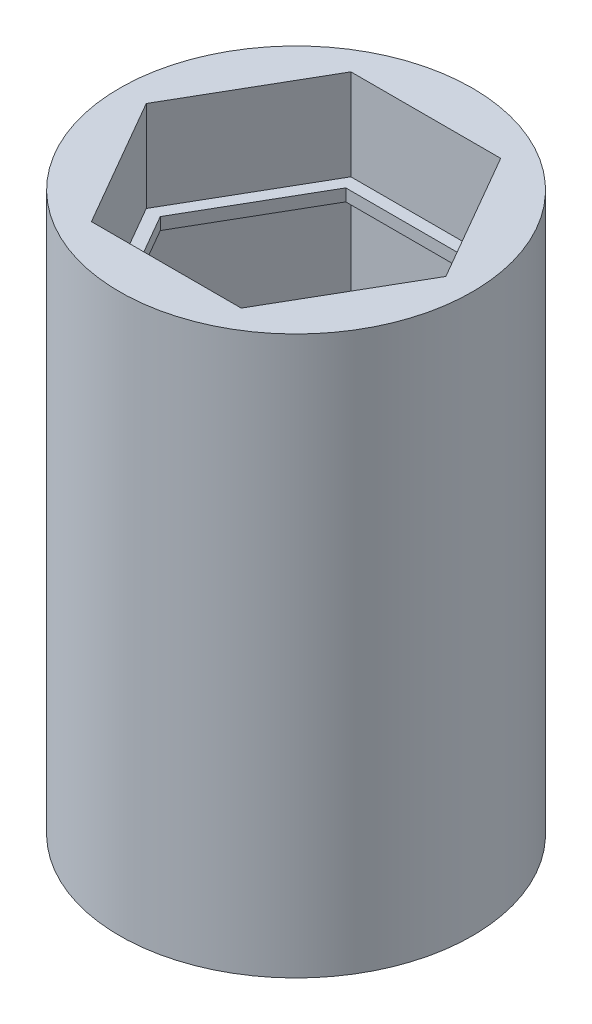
ISO-10303-21;
HEADER;
FILE_DESCRIPTION(('STEP AP214'),'2;1');
FILE_NAME('part.step','',(''),(''),'','','');
FILE_SCHEMA(('AUTOMOTIVE_DESIGN { 1 0 10303 214 1 1 1 1 }'));
ENDSEC;
DATA;
#1=APPLICATION_CONTEXT('core data for automotive mechanical design processes');
#2=APPLICATION_PROTOCOL_DEFINITION('international standard','automotive_design',2000,#1);
#3=PRODUCT_CONTEXT('',#1,'mechanical');
#4=PRODUCT('Part','Part','',(#3));
#5=PRODUCT_RELATED_PRODUCT_CATEGORY('part','',(#4));
#6=PRODUCT_DEFINITION_FORMATION('','',#4);
#7=PRODUCT_DEFINITION_CONTEXT('part definition',#1,'design');
#8=PRODUCT_DEFINITION('design','',#6,#7);
#9=PRODUCT_DEFINITION_SHAPE('','',#8);
#10=(LENGTH_UNIT() NAMED_UNIT(*) SI_UNIT(.MILLI.,.METRE.));
#11=(NAMED_UNIT(*) PLANE_ANGLE_UNIT() SI_UNIT($,.RADIAN.));
#12=(NAMED_UNIT(*) SI_UNIT($,.STERADIAN.) SOLID_ANGLE_UNIT());
#13=UNCERTAINTY_MEASURE_WITH_UNIT(LENGTH_MEASURE(1.E-05),#10,'distance_accuracy_value','');
#14=(GEOMETRIC_REPRESENTATION_CONTEXT(3) GLOBAL_UNCERTAINTY_ASSIGNED_CONTEXT((#13)) GLOBAL_UNIT_ASSIGNED_CONTEXT((#10,
#11,#12)) REPRESENTATION_CONTEXT('',''));
#15=CARTESIAN_POINT('',(0.,0.,0.));
#16=DIRECTION('',(0.,0.,1.));
#17=DIRECTION('',(1.,0.,0.));
#18=AXIS2_PLACEMENT_3D('',#15,#16,#17);
#19=CARTESIAN_POINT('',(0.,58.42,0.));
#20=DIRECTION('',(0.,-1.,0.));
#21=DIRECTION('',(0.,0.,-1.));
#22=AXIS2_PLACEMENT_3D('',#19,#20,#21);
#23=CYLINDRICAL_SURFACE('',#22,18.4785);
#24=CARTESIAN_POINT('',(0.,58.42,0.));
#25=DIRECTION('',(0.,1.,0.));
#26=DIRECTION('',(0.,0.,1.));
#27=AXIS2_PLACEMENT_3D('',#24,#25,#26);
#28=CIRCLE('',#27,18.4785);
#29=CARTESIAN_POINT('',(0.,58.42,-18.4785));
#30=VERTEX_POINT('',#29);
#31=EDGE_CURVE('E362',#30,#30,#28,.T.);
#32=CARTESIAN_POINT('',(0.,0.,0.));
#33=DIRECTION('',(0.,1.,0.));
#34=DIRECTION('',(0.,0.,1.));
#35=AXIS2_PLACEMENT_3D('',#32,#33,#34);
#36=CIRCLE('',#35,18.4785);
#37=CARTESIAN_POINT('',(0.,0.,-18.4785));
#38=VERTEX_POINT('',#37);
#39=EDGE_CURVE('E351',#38,#38,#36,.T.);
#40=CARTESIAN_POINT('',(0.,58.42,-18.4785));
#41=CARTESIAN_POINT('',(0.,57.8114583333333,-18.4785));
#42=CARTESIAN_POINT('',(0.,57.2029166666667,-18.4785));
#43=CARTESIAN_POINT('',(0.,55.9858333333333,-18.4785));
#44=CARTESIAN_POINT('',(0.,55.3772916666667,-18.4785));
#45=CARTESIAN_POINT('',(0.,54.1602083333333,-18.4785));
#46=CARTESIAN_POINT('',(0.,53.5516666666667,-18.4785));
#47=CARTESIAN_POINT('',(0.,52.3345833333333,-18.4785));
#48=CARTESIAN_POINT('',(0.,51.7260416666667,-18.4785));
#49=CARTESIAN_POINT('',(0.,50.5089583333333,-18.4785));
#50=CARTESIAN_POINT('',(0.,49.9004166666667,-18.4785));
#51=CARTESIAN_POINT('',(0.,48.6833333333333,-18.4785));
#52=CARTESIAN_POINT('',(0.,48.0747916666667,-18.4785));
#53=CARTESIAN_POINT('',(0.,46.8577083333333,-18.4785));
#54=CARTESIAN_POINT('',(0.,46.2491666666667,-18.4785));
#55=CARTESIAN_POINT('',(0.,45.0320833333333,-18.4785));
#56=CARTESIAN_POINT('',(0.,44.4235416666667,-18.4785));
#57=CARTESIAN_POINT('',(0.,43.2064583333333,-18.4785));
#58=CARTESIAN_POINT('',(0.,42.5979166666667,-18.4785));
#59=CARTESIAN_POINT('',(0.,41.3808333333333,-18.4785));
#60=CARTESIAN_POINT('',(0.,40.7722916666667,-18.4785));
#61=CARTESIAN_POINT('',(0.,39.5552083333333,-18.4785));
#62=CARTESIAN_POINT('',(0.,38.9466666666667,-18.4785));
#63=CARTESIAN_POINT('',(0.,37.7295833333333,-18.4785));
#64=CARTESIAN_POINT('',(0.,37.1210416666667,-18.4785));
#65=CARTESIAN_POINT('',(0.,35.9039583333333,-18.4785));
#66=CARTESIAN_POINT('',(0.,35.2954166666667,-18.4785));
#67=CARTESIAN_POINT('',(0.,34.0783333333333,-18.4785));
#68=CARTESIAN_POINT('',(0.,33.4697916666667,-18.4785));
#69=CARTESIAN_POINT('',(0.,32.2527083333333,-18.4785));
#70=CARTESIAN_POINT('',(0.,31.6441666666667,-18.4785));
#71=CARTESIAN_POINT('',(0.,30.4270833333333,-18.4785));
#72=CARTESIAN_POINT('',(0.,29.8185416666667,-18.4785));
#73=CARTESIAN_POINT('',(0.,28.6014583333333,-18.4785));
#74=CARTESIAN_POINT('',(0.,27.9929166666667,-18.4785));
#75=CARTESIAN_POINT('',(0.,26.7758333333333,-18.4785));
#76=CARTESIAN_POINT('',(0.,26.1672916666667,-18.4785));
#77=CARTESIAN_POINT('',(0.,24.9502083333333,-18.4785));
#78=CARTESIAN_POINT('',(0.,24.3416666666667,-18.4785));
#79=CARTESIAN_POINT('',(0.,23.1245833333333,-18.4785));
#80=CARTESIAN_POINT('',(0.,22.5160416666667,-18.4785));
#81=CARTESIAN_POINT('',(0.,21.2989583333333,-18.4785));
#82=CARTESIAN_POINT('',(0.,20.6904166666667,-18.4785));
#83=CARTESIAN_POINT('',(0.,19.4733333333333,-18.4785));
#84=CARTESIAN_POINT('',(0.,18.8647916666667,-18.4785));
#85=CARTESIAN_POINT('',(0.,17.6477083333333,-18.4785));
#86=CARTESIAN_POINT('',(0.,17.0391666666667,-18.4785));
#87=CARTESIAN_POINT('',(0.,15.8220833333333,-18.4785));
#88=CARTESIAN_POINT('',(0.,15.2135416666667,-18.4785));
#89=CARTESIAN_POINT('',(0.,13.9964583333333,-18.4785));
#90=CARTESIAN_POINT('',(0.,13.3879166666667,-18.4785));
#91=CARTESIAN_POINT('',(0.,12.1708333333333,-18.4785));
#92=CARTESIAN_POINT('',(0.,11.5622916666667,-18.4785));
#93=CARTESIAN_POINT('',(0.,10.3452083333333,-18.4785));
#94=CARTESIAN_POINT('',(0.,9.73666666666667,-18.4785));
#95=CARTESIAN_POINT('',(0.,8.51958333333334,-18.4785));
#96=CARTESIAN_POINT('',(0.,7.91104166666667,-18.4785));
#97=CARTESIAN_POINT('',(0.,6.69395833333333,-18.4785));
#98=CARTESIAN_POINT('',(0.,6.08541666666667,-18.4785));
#99=CARTESIAN_POINT('',(0.,4.86833333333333,-18.4785));
#100=CARTESIAN_POINT('',(0.,4.25979166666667,-18.4785));
#101=CARTESIAN_POINT('',(0.,3.04270833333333,-18.4785));
#102=CARTESIAN_POINT('',(0.,2.43416666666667,-18.4785));
#103=CARTESIAN_POINT('',(0.,1.21708333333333,-18.4785));
#104=CARTESIAN_POINT('',(0.,0.608541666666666,-18.4785));
#105=CARTESIAN_POINT('',(0.,0.,-18.4785));
#106=B_SPLINE_CURVE_WITH_KNOTS('',3,(#40,#41,#42,#43,#44,#45,#46,#47,#48,#49,#50,#51,#52,#53,
#54,#55,#56,#57,#58,#59,#60,#61,#62,#63,#64,#65,#66,#67,#68,#69,#70,#71,#72,#73,#74,#75,#76,#77,
#78,#79,#80,#81,#82,#83,#84,#85,#86,#87,#88,#89,#90,#91,#92,#93,#94,#95,#96,#97,#98,#99,#100,
#101,#102,#103,#104,#105),.UNSPECIFIED.,.F.,.F.,(4,2,2,2,2,2,2,2,2,2,2,2,2,2,2,2,2,2,2,2,2,2,2,
2,2,2,2,2,2,2,2,2,4),(0.,1.825625,3.65125,5.476875,7.3025,9.128125,10.95375,12.779375,14.605,
16.430625,18.25625,20.081875,21.9075,23.733125,25.55875,27.384375,29.21,31.035625,32.86125,
34.686875,36.5125,38.338125,40.16375,41.989375,43.815,45.640625,47.46625,49.291875,51.1175,
52.943125,54.76875,56.594375,58.42),.UNSPECIFIED.);
#107=EDGE_CURVE('BSEAM35',#30,#38,#106,.T.);
#108=ORIENTED_EDGE('',*,*,#31,.F.);
#109=ORIENTED_EDGE('',*,*,#39,.T.);
#110=ORIENTED_EDGE('',*,*,#107,.T.);
#111=ORIENTED_EDGE('',*,*,#107,.F.);
#112=EDGE_LOOP('',(#108,#110,#109,#111));
#113=FACE_BOUND('',#112,.T.);
#114=ADVANCED_FACE('F35',(#113),#23,.T.);
#115=CARTESIAN_POINT('',(0.,58.42,0.));
#116=DIRECTION('',(0.,1.,0.));
#117=DIRECTION('',(0.,0.,1.));
#118=AXIS2_PLACEMENT_3D('',#115,#116,#117);
#119=PLANE('',#118);
#120=DIRECTION('',(0.5,0.,-0.866025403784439));
#121=VECTOR('',#120,1.);
#122=CARTESIAN_POINT('',(7.84561280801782,58.42,13.589));
#123=LINE('',#122,#121);
#124=CARTESIAN_POINT('',(7.84561280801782,58.42,13.589));
#125=VERTEX_POINT('',#124);
#126=CARTESIAN_POINT('',(15.6912256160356,58.42,0.));
#127=VERTEX_POINT('',#126);
#128=EDGE_CURVE('E304',#125,#127,#123,.T.);
#129=ORIENTED_EDGE('',*,*,#128,.F.);
#130=DIRECTION('',(1.,0.,0.));
#131=VECTOR('',#130,1.);
#132=CARTESIAN_POINT('',(-7.84561280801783,58.42,13.589));
#133=LINE('',#132,#131);
#134=CARTESIAN_POINT('',(-7.84561280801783,58.42,13.589));
#135=VERTEX_POINT('',#134);
#136=EDGE_CURVE('E318',#135,#125,#133,.T.);
#137=ORIENTED_EDGE('',*,*,#136,.F.);
#138=DIRECTION('',(0.5,0.,0.866025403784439));
#139=VECTOR('',#138,1.);
#140=CARTESIAN_POINT('',(-15.6912256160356,58.42,0.));
#141=LINE('',#140,#139);
#142=CARTESIAN_POINT('',(-15.6912256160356,58.42,0.));
#143=VERTEX_POINT('',#142);
#144=EDGE_CURVE('E344',#143,#135,#141,.T.);
#145=ORIENTED_EDGE('',*,*,#144,.F.);
#146=DIRECTION('',(-0.5,0.,0.866025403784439));
#147=VECTOR('',#146,1.);
#148=CARTESIAN_POINT('',(-7.84561280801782,58.42,-13.589));
#149=LINE('',#148,#147);
#150=CARTESIAN_POINT('',(-7.84561280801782,58.42,-13.589));
#151=VERTEX_POINT('',#150);
#152=EDGE_CURVE('E341',#151,#143,#149,.T.);
#153=ORIENTED_EDGE('',*,*,#152,.F.);
#154=DIRECTION('',(-1.,0.,0.));
#155=VECTOR('',#154,1.);
#156=CARTESIAN_POINT('',(7.84561280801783,58.42,-13.589));
#157=LINE('',#156,#155);
#158=CARTESIAN_POINT('',(7.84561280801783,58.42,-13.589));
#159=VERTEX_POINT('',#158);
#160=EDGE_CURVE('E338',#159,#151,#157,.T.);
#161=ORIENTED_EDGE('',*,*,#160,.F.);
#162=DIRECTION('',(-0.5,0.,-0.866025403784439));
#163=VECTOR('',#162,1.);
#164=CARTESIAN_POINT('',(15.6912256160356,58.42,0.));
#165=LINE('',#164,#163);
#166=EDGE_CURVE('E335',#127,#159,#165,.T.);
#167=ORIENTED_EDGE('',*,*,#166,.F.);
#168=EDGE_LOOP('',(#129,#137,#145,#153,#161,#167));
#169=FACE_BOUND('',#168,.T.);
#170=ORIENTED_EDGE('',*,*,#31,.T.);
#171=EDGE_LOOP('',(#170));
#172=FACE_BOUND('',#171,.T.);
#173=ADVANCED_FACE('F447',(#169,#172),#119,.T.);
#174=CARTESIAN_POINT('',(0.,0.,0.));
#175=DIRECTION('',(0.,1.,0.));
#176=DIRECTION('',(0.,0.,1.));
#177=AXIS2_PLACEMENT_3D('',#174,#175,#176);
#178=PLANE('',#177);
#179=DIRECTION('',(1.,0.,0.));
#180=VECTOR('',#179,1.);
#181=CARTESIAN_POINT('',(-4.826,0.,-4.826));
#182=LINE('',#181,#180);
#183=CARTESIAN_POINT('',(-4.826,0.,-4.826));
#184=VERTEX_POINT('',#183);
#185=CARTESIAN_POINT('',(4.826,0.,-4.826));
#186=VERTEX_POINT('',#185);
#187=EDGE_CURVE('E219',#184,#186,#182,.T.);
#188=ORIENTED_EDGE('',*,*,#187,.F.);
#189=DIRECTION('',(0.,0.,-1.));
#190=VECTOR('',#189,1.);
#191=CARTESIAN_POINT('',(-4.826,0.,-4.826));
#192=LINE('',#191,#190);
#193=CARTESIAN_POINT('',(-4.826,0.,4.826));
#194=VERTEX_POINT('',#193);
#195=EDGE_CURVE('E224',#194,#184,#192,.T.);
#196=ORIENTED_EDGE('',*,*,#195,.F.);
#197=DIRECTION('',(-1.,0.,0.));
#198=VECTOR('',#197,1.);
#199=CARTESIAN_POINT('',(-4.826,0.,4.826));
#200=LINE('',#199,#198);
#201=CARTESIAN_POINT('',(4.826,0.,4.826));
#202=VERTEX_POINT('',#201);
#203=EDGE_CURVE('E229',#202,#194,#200,.T.);
#204=ORIENTED_EDGE('',*,*,#203,.F.);
#205=DIRECTION('',(0.,0.,1.));
#206=VECTOR('',#205,1.);
#207=CARTESIAN_POINT('',(4.826,0.,-4.826));
#208=LINE('',#207,#206);
#209=EDGE_CURVE('E208',#186,#202,#208,.T.);
#210=ORIENTED_EDGE('',*,*,#209,.F.);
#211=EDGE_LOOP('',(#188,#196,#204,#210));
#212=FACE_BOUND('',#211,.T.);
#213=ORIENTED_EDGE('',*,*,#39,.F.);
#214=EDGE_LOOP('',(#213));
#215=FACE_BOUND('',#214,.T.);
#216=ADVANCED_FACE('F226',(#212,#215),#178,.F.);
#217=CARTESIAN_POINT('',(7.84561280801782,48.895,13.589));
#218=DIRECTION('',(0.866025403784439,0.,0.5));
#219=DIRECTION('',(0.5,0.,-0.866025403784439));
#220=AXIS2_PLACEMENT_3D('',#217,#218,#219);
#221=PLANE('',#220);
#222=ORIENTED_EDGE('',*,*,#128,.T.);
#223=DIRECTION('',(0.,1.,0.));
#224=VECTOR('',#223,1.);
#225=CARTESIAN_POINT('',(15.6912256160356,48.895,0.));
#226=LINE('',#225,#224);
#227=CARTESIAN_POINT('',(15.6912256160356,48.895,0.));
#228=VERTEX_POINT('',#227);
#229=EDGE_CURVE('E333',#228,#127,#226,.T.);
#230=ORIENTED_EDGE('',*,*,#229,.F.);
#231=DIRECTION('',(0.5,0.,-0.866025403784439));
#232=VECTOR('',#231,1.);
#233=CARTESIAN_POINT('',(7.84561280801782,48.895,13.589));
#234=LINE('',#233,#232);
#235=CARTESIAN_POINT('',(7.84561280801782,48.895,13.589));
#236=VERTEX_POINT('',#235);
#237=EDGE_CURVE('E314',#236,#228,#234,.T.);
#238=ORIENTED_EDGE('',*,*,#237,.F.);
#239=DIRECTION('',(0.,1.,0.));
#240=VECTOR('',#239,1.);
#241=CARTESIAN_POINT('',(7.84561280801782,48.895,13.589));
#242=LINE('',#241,#240);
#243=EDGE_CURVE('E349',#236,#125,#242,.T.);
#244=ORIENTED_EDGE('',*,*,#243,.T.);
#245=EDGE_LOOP('',(#222,#230,#238,#244));
#246=FACE_BOUND('',#245,.T.);
#247=ADVANCED_FACE('F562',(#246),#221,.F.);
#248=CARTESIAN_POINT('',(-7.84561280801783,48.895,13.589));
#249=DIRECTION('',(0.,0.,1.));
#250=DIRECTION('',(1.,0.,0.));
#251=AXIS2_PLACEMENT_3D('',#248,#249,#250);
#252=PLANE('',#251);
#253=ORIENTED_EDGE('',*,*,#136,.T.);
#254=ORIENTED_EDGE('',*,*,#243,.F.);
#255=DIRECTION('',(1.,0.,0.));
#256=VECTOR('',#255,1.);
#257=CARTESIAN_POINT('',(-7.84561280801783,48.895,13.589));
#258=LINE('',#257,#256);
#259=CARTESIAN_POINT('',(-7.84561280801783,48.895,13.589));
#260=VERTEX_POINT('',#259);
#261=EDGE_CURVE('E330',#260,#236,#258,.T.);
#262=ORIENTED_EDGE('',*,*,#261,.F.);
#263=DIRECTION('',(0.,1.,0.));
#264=VECTOR('',#263,1.);
#265=CARTESIAN_POINT('',(-7.84561280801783,48.895,13.589));
#266=LINE('',#265,#264);
#267=EDGE_CURVE('E352',#260,#135,#266,.T.);
#268=ORIENTED_EDGE('',*,*,#267,.T.);
#269=EDGE_LOOP('',(#253,#254,#262,#268));
#270=FACE_BOUND('',#269,.T.);
#271=ADVANCED_FACE('F558',(#270),#252,.F.);
#272=CARTESIAN_POINT('',(-15.6912256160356,48.895,0.));
#273=DIRECTION('',(-0.866025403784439,0.,0.5));
#274=DIRECTION('',(0.5,0.,0.866025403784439));
#275=AXIS2_PLACEMENT_3D('',#272,#273,#274);
#276=PLANE('',#275);
#277=ORIENTED_EDGE('',*,*,#144,.T.);
#278=ORIENTED_EDGE('',*,*,#267,.F.);
#279=DIRECTION('',(0.5,0.,0.866025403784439));
#280=VECTOR('',#279,1.);
#281=CARTESIAN_POINT('',(-15.6912256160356,48.895,0.));
#282=LINE('',#281,#280);
#283=CARTESIAN_POINT('',(-15.6912256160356,48.895,0.));
#284=VERTEX_POINT('',#283);
#285=EDGE_CURVE('E327',#284,#260,#282,.T.);
#286=ORIENTED_EDGE('',*,*,#285,.F.);
#287=DIRECTION('',(0.,1.,0.));
#288=VECTOR('',#287,1.);
#289=CARTESIAN_POINT('',(-15.6912256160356,48.895,0.));
#290=LINE('',#289,#288);
#291=EDGE_CURVE('E354',#284,#143,#290,.T.);
#292=ORIENTED_EDGE('',*,*,#291,.T.);
#293=EDGE_LOOP('',(#277,#278,#286,#292));
#294=FACE_BOUND('',#293,.T.);
#295=ADVANCED_FACE('F561',(#294),#276,.F.);
#296=CARTESIAN_POINT('',(-7.84561280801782,48.895,-13.589));
#297=DIRECTION('',(-0.866025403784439,0.,-0.5));
#298=DIRECTION('',(-0.5,0.,0.866025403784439));
#299=AXIS2_PLACEMENT_3D('',#296,#297,#298);
#300=PLANE('',#299);
#301=ORIENTED_EDGE('',*,*,#152,.T.);
#302=ORIENTED_EDGE('',*,*,#291,.F.);
#303=DIRECTION('',(-0.5,0.,0.866025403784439));
#304=VECTOR('',#303,1.);
#305=CARTESIAN_POINT('',(-7.84561280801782,48.895,-13.589));
#306=LINE('',#305,#304);
#307=CARTESIAN_POINT('',(-7.84561280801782,48.895,-13.589));
#308=VERTEX_POINT('',#307);
#309=EDGE_CURVE('E324',#308,#284,#306,.T.);
#310=ORIENTED_EDGE('',*,*,#309,.F.);
#311=DIRECTION('',(0.,1.,0.));
#312=VECTOR('',#311,1.);
#313=CARTESIAN_POINT('',(-7.84561280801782,48.895,-13.589));
#314=LINE('',#313,#312);
#315=EDGE_CURVE('E356',#308,#151,#314,.T.);
#316=ORIENTED_EDGE('',*,*,#315,.T.);
#317=EDGE_LOOP('',(#301,#302,#310,#316));
#318=FACE_BOUND('',#317,.T.);
#319=ADVANCED_FACE('F566',(#318),#300,.F.);
#320=CARTESIAN_POINT('',(7.84561280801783,48.895,-13.589));
#321=DIRECTION('',(0.,0.,-1.));
#322=DIRECTION('',(-1.,0.,0.));
#323=AXIS2_PLACEMENT_3D('',#320,#321,#322);
#324=PLANE('',#323);
#325=ORIENTED_EDGE('',*,*,#160,.T.);
#326=ORIENTED_EDGE('',*,*,#315,.F.);
#327=DIRECTION('',(-1.,0.,0.));
#328=VECTOR('',#327,1.);
#329=CARTESIAN_POINT('',(7.84561280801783,48.895,-13.589));
#330=LINE('',#329,#328);
#331=CARTESIAN_POINT('',(7.84561280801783,48.895,-13.589));
#332=VERTEX_POINT('',#331);
#333=EDGE_CURVE('E321',#332,#308,#330,.T.);
#334=ORIENTED_EDGE('',*,*,#333,.F.);
#335=DIRECTION('',(0.,1.,0.));
#336=VECTOR('',#335,1.);
#337=CARTESIAN_POINT('',(7.84561280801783,48.895,-13.589));
#338=LINE('',#337,#336);
#339=EDGE_CURVE('E358',#332,#159,#338,.T.);
#340=ORIENTED_EDGE('',*,*,#339,.T.);
#341=EDGE_LOOP('',(#325,#326,#334,#340));
#342=FACE_BOUND('',#341,.T.);
#343=ADVANCED_FACE('F570',(#342),#324,.F.);
#344=CARTESIAN_POINT('',(15.6912256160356,48.895,0.));
#345=DIRECTION('',(0.866025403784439,0.,-0.5));
#346=DIRECTION('',(-0.5,0.,-0.866025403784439));
#347=AXIS2_PLACEMENT_3D('',#344,#345,#346);
#348=PLANE('',#347);
#349=ORIENTED_EDGE('',*,*,#166,.T.);
#350=ORIENTED_EDGE('',*,*,#339,.F.);
#351=DIRECTION('',(-0.5,0.,-0.866025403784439));
#352=VECTOR('',#351,1.);
#353=CARTESIAN_POINT('',(15.6912256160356,48.895,0.));
#354=LINE('',#353,#352);
#355=EDGE_CURVE('E317',#228,#332,#354,.T.);
#356=ORIENTED_EDGE('',*,*,#355,.F.);
#357=ORIENTED_EDGE('',*,*,#229,.T.);
#358=EDGE_LOOP('',(#349,#350,#356,#357));
#359=FACE_BOUND('',#358,.T.);
#360=ADVANCED_FACE('F556',(#359),#348,.F.);
#361=CARTESIAN_POINT('',(0.,48.895,0.));
#362=DIRECTION('',(0.,1.,0.));
#363=DIRECTION('',(0.,0.,1.));
#364=AXIS2_PLACEMENT_3D('',#361,#362,#363);
#365=PLANE('',#364);
#366=DIRECTION('',(0.5,0.,-0.866025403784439));
#367=VECTOR('',#366,1.);
#368=CARTESIAN_POINT('',(7.112377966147,48.895,12.319));
#369=LINE('',#368,#367);
#370=CARTESIAN_POINT('',(7.112377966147,48.895,12.319));
#371=VERTEX_POINT('',#370);
#372=CARTESIAN_POINT('',(14.224755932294,48.895,0.));
#373=VERTEX_POINT('',#372);
#374=EDGE_CURVE('E283',#371,#373,#369,.T.);
#375=ORIENTED_EDGE('',*,*,#374,.F.);
#376=DIRECTION('',(1.,0.,0.));
#377=VECTOR('',#376,1.);
#378=CARTESIAN_POINT('',(-7.112377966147,48.895,12.319));
#379=LINE('',#378,#377);
#380=CARTESIAN_POINT('',(-7.112377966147,48.895,12.319));
#381=VERTEX_POINT('',#380);
#382=EDGE_CURVE('E298',#381,#371,#379,.T.);
#383=ORIENTED_EDGE('',*,*,#382,.F.);
#384=DIRECTION('',(0.5,0.,0.866025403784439));
#385=VECTOR('',#384,1.);
#386=CARTESIAN_POINT('',(-14.224755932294,48.895,0.));
#387=LINE('',#386,#385);
#388=CARTESIAN_POINT('',(-14.224755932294,48.895,0.));
#389=VERTEX_POINT('',#388);
#390=EDGE_CURVE('E295',#389,#381,#387,.T.);
#391=ORIENTED_EDGE('',*,*,#390,.F.);
#392=DIRECTION('',(-0.5,0.,0.866025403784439));
#393=VECTOR('',#392,1.);
#394=CARTESIAN_POINT('',(-7.112377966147,48.895,-12.319));
#395=LINE('',#394,#393);
#396=CARTESIAN_POINT('',(-7.112377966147,48.895,-12.319));
#397=VERTEX_POINT('',#396);
#398=EDGE_CURVE('E292',#397,#389,#395,.T.);
#399=ORIENTED_EDGE('',*,*,#398,.F.);
#400=DIRECTION('',(-1.,0.,0.));
#401=VECTOR('',#400,1.);
#402=CARTESIAN_POINT('',(7.112377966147,48.895,-12.319));
#403=LINE('',#402,#401);
#404=CARTESIAN_POINT('',(7.112377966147,48.895,-12.319));
#405=VERTEX_POINT('',#404);
#406=EDGE_CURVE('E289',#405,#397,#403,.T.);
#407=ORIENTED_EDGE('',*,*,#406,.F.);
#408=DIRECTION('',(-0.5,0.,-0.866025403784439));
#409=VECTOR('',#408,1.);
#410=CARTESIAN_POINT('',(14.224755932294,48.895,0.));
#411=LINE('',#410,#409);
#412=EDGE_CURVE('E286',#373,#405,#411,.T.);
#413=ORIENTED_EDGE('',*,*,#412,.F.);
#414=EDGE_LOOP('',(#375,#383,#391,#399,#407,#413));
#415=FACE_BOUND('',#414,.T.);
#416=ORIENTED_EDGE('',*,*,#237,.T.);
#417=ORIENTED_EDGE('',*,*,#355,.T.);
#418=ORIENTED_EDGE('',*,*,#333,.T.);
#419=ORIENTED_EDGE('',*,*,#309,.T.);
#420=ORIENTED_EDGE('',*,*,#285,.T.);
#421=ORIENTED_EDGE('',*,*,#261,.T.);
#422=EDGE_LOOP('',(#416,#417,#418,#419,#420,#421));
#423=FACE_BOUND('',#422,.T.);
#424=ADVANCED_FACE('F552',(#415,#423),#365,.T.);
#425=CARTESIAN_POINT('',(7.112377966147,10.795,12.319));
#426=DIRECTION('',(0.866025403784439,0.,0.5));
#427=DIRECTION('',(0.5,0.,-0.866025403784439));
#428=AXIS2_PLACEMENT_3D('',#425,#426,#427);
#429=PLANE('',#428);
#430=DIRECTION('',(0.,1.,0.));
#431=VECTOR('',#430,1.);
#432=CARTESIAN_POINT('',(14.224755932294,10.795,0.));
#433=LINE('',#432,#431);
#434=CARTESIAN_POINT('',(14.224755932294,47.625,0.));
#435=VERTEX_POINT('',#434);
#436=EDGE_CURVE('E301',#435,#373,#433,.T.);
#437=ORIENTED_EDGE('',*,*,#436,.F.);
#438=DIRECTION('',(-0.5,0.,0.866025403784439));
#439=VECTOR('',#438,1.);
#440=CARTESIAN_POINT('',(7.112377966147,47.625,12.319));
#441=LINE('',#440,#439);
#442=CARTESIAN_POINT('',(7.112377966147,47.625,12.319));
#443=VERTEX_POINT('',#442);
#444=EDGE_CURVE('E280',#435,#443,#441,.T.);
#445=ORIENTED_EDGE('',*,*,#444,.T.);
#446=DIRECTION('',(0.,1.,0.));
#447=VECTOR('',#446,1.);
#448=CARTESIAN_POINT('',(7.112377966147,10.795,12.319));
#449=LINE('',#448,#447);
#450=EDGE_CURVE('E302',#443,#371,#449,.T.);
#451=ORIENTED_EDGE('',*,*,#450,.T.);
#452=ORIENTED_EDGE('',*,*,#374,.T.);
#453=EDGE_LOOP('',(#437,#445,#451,#452));
#454=FACE_BOUND('',#453,.T.);
#455=ADVANCED_FACE('F534',(#454),#429,.F.);
#456=CARTESIAN_POINT('',(-7.112377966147,10.795,12.319));
#457=DIRECTION('',(0.,0.,1.));
#458=DIRECTION('',(1.,0.,0.));
#459=AXIS2_PLACEMENT_3D('',#456,#457,#458);
#460=PLANE('',#459);
#461=ORIENTED_EDGE('',*,*,#450,.F.);
#462=DIRECTION('',(-1.,0.,0.));
#463=VECTOR('',#462,1.);
#464=CARTESIAN_POINT('',(-7.112377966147,47.625,12.319));
#465=LINE('',#464,#463);
#466=CARTESIAN_POINT('',(-7.11237796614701,47.625,12.319));
#467=VERTEX_POINT('',#466);
#468=EDGE_CURVE('E277',#443,#467,#465,.T.);
#469=ORIENTED_EDGE('',*,*,#468,.T.);
#470=DIRECTION('',(0.,1.,0.));
#471=VECTOR('',#470,1.);
#472=CARTESIAN_POINT('',(-7.112377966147,10.795,12.319));
#473=LINE('',#472,#471);
#474=EDGE_CURVE('E305',#467,#381,#473,.T.);
#475=ORIENTED_EDGE('',*,*,#474,.T.);
#476=ORIENTED_EDGE('',*,*,#382,.T.);
#477=EDGE_LOOP('',(#461,#469,#475,#476));
#478=FACE_BOUND('',#477,.T.);
#479=ADVANCED_FACE('F530',(#478),#460,.F.);
#480=CARTESIAN_POINT('',(-14.224755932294,10.795,0.));
#481=DIRECTION('',(-0.866025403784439,0.,0.5));
#482=DIRECTION('',(0.5,0.,0.866025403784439));
#483=AXIS2_PLACEMENT_3D('',#480,#481,#482);
#484=PLANE('',#483);
#485=ORIENTED_EDGE('',*,*,#474,.F.);
#486=DIRECTION('',(-0.5,0.,-0.866025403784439));
#487=VECTOR('',#486,1.);
#488=CARTESIAN_POINT('',(-14.224755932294,47.625,0.));
#489=LINE('',#488,#487);
#490=CARTESIAN_POINT('',(-14.224755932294,47.625,0.));
#491=VERTEX_POINT('',#490);
#492=EDGE_CURVE('E274',#467,#491,#489,.T.);
#493=ORIENTED_EDGE('',*,*,#492,.T.);
#494=DIRECTION('',(0.,1.,0.));
#495=VECTOR('',#494,1.);
#496=CARTESIAN_POINT('',(-14.224755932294,10.795,0.));
#497=LINE('',#496,#495);
#498=EDGE_CURVE('E307',#491,#389,#497,.T.);
#499=ORIENTED_EDGE('',*,*,#498,.T.);
#500=ORIENTED_EDGE('',*,*,#390,.T.);
#501=EDGE_LOOP('',(#485,#493,#499,#500));
#502=FACE_BOUND('',#501,.T.);
#503=ADVANCED_FACE('F533',(#502),#484,.F.);
#504=CARTESIAN_POINT('',(-7.112377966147,10.795,-12.319));
#505=DIRECTION('',(-0.866025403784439,0.,-0.5));
#506=DIRECTION('',(-0.5,0.,0.866025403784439));
#507=AXIS2_PLACEMENT_3D('',#504,#505,#506);
#508=PLANE('',#507);
#509=ORIENTED_EDGE('',*,*,#498,.F.);
#510=DIRECTION('',(0.5,0.,-0.866025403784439));
#511=VECTOR('',#510,1.);
#512=CARTESIAN_POINT('',(-7.112377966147,47.625,-12.319));
#513=LINE('',#512,#511);
#514=CARTESIAN_POINT('',(-7.112377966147,47.625,-12.319));
#515=VERTEX_POINT('',#514);
#516=EDGE_CURVE('E271',#491,#515,#513,.T.);
#517=ORIENTED_EDGE('',*,*,#516,.T.);
#518=DIRECTION('',(0.,1.,0.));
#519=VECTOR('',#518,1.);
#520=CARTESIAN_POINT('',(-7.112377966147,10.795,-12.319));
#521=LINE('',#520,#519);
#522=EDGE_CURVE('E309',#515,#397,#521,.T.);
#523=ORIENTED_EDGE('',*,*,#522,.T.);
#524=ORIENTED_EDGE('',*,*,#398,.T.);
#525=EDGE_LOOP('',(#509,#517,#523,#524));
#526=FACE_BOUND('',#525,.T.);
#527=ADVANCED_FACE('F538',(#526),#508,.F.);
#528=CARTESIAN_POINT('',(7.112377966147,10.795,-12.319));
#529=DIRECTION('',(0.,0.,-1.));
#530=DIRECTION('',(-1.,0.,0.));
#531=AXIS2_PLACEMENT_3D('',#528,#529,#530);
#532=PLANE('',#531);
#533=ORIENTED_EDGE('',*,*,#522,.F.);
#534=DIRECTION('',(1.,0.,0.));
#535=VECTOR('',#534,1.);
#536=CARTESIAN_POINT('',(7.112377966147,47.625,-12.319));
#537=LINE('',#536,#535);
#538=CARTESIAN_POINT('',(7.112377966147,47.625,-12.319));
#539=VERTEX_POINT('',#538);
#540=EDGE_CURVE('E259',#515,#539,#537,.T.);
#541=ORIENTED_EDGE('',*,*,#540,.T.);
#542=DIRECTION('',(0.,1.,0.));
#543=VECTOR('',#542,1.);
#544=CARTESIAN_POINT('',(7.112377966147,10.795,-12.319));
#545=LINE('',#544,#543);
#546=EDGE_CURVE('E311',#539,#405,#545,.T.);
#547=ORIENTED_EDGE('',*,*,#546,.T.);
#548=ORIENTED_EDGE('',*,*,#406,.T.);
#549=EDGE_LOOP('',(#533,#541,#547,#548));
#550=FACE_BOUND('',#549,.T.);
#551=ADVANCED_FACE('F542',(#550),#532,.F.);
#552=CARTESIAN_POINT('',(14.224755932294,10.795,0.));
#553=DIRECTION('',(0.866025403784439,0.,-0.5));
#554=DIRECTION('',(-0.5,0.,-0.866025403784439));
#555=AXIS2_PLACEMENT_3D('',#552,#553,#554);
#556=PLANE('',#555);
#557=ORIENTED_EDGE('',*,*,#546,.F.);
#558=DIRECTION('',(0.5,0.,0.866025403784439));
#559=VECTOR('',#558,1.);
#560=CARTESIAN_POINT('',(14.224755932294,47.625,0.));
#561=LINE('',#560,#559);
#562=EDGE_CURVE('E365',#539,#435,#561,.T.);
#563=ORIENTED_EDGE('',*,*,#562,.T.);
#564=ORIENTED_EDGE('',*,*,#436,.T.);
#565=ORIENTED_EDGE('',*,*,#412,.T.);
#566=EDGE_LOOP('',(#557,#563,#564,#565));
#567=FACE_BOUND('',#566,.T.);
#568=ADVANCED_FACE('F525',(#567),#556,.F.);
#569=CARTESIAN_POINT('',(0.,47.625,0.));
#570=DIRECTION('',(0.,1.,0.));
#571=DIRECTION('',(0.,0.,1.));
#572=AXIS2_PLACEMENT_3D('',#569,#570,#571);
#573=PLANE('',#572);
#574=DIRECTION('',(0.499999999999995,0.,-0.866025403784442));
#575=VECTOR('',#574,1.);
#576=CARTESIAN_POINT('',(7.84561280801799,47.625,13.5889999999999));
#577=LINE('',#576,#575);
#578=CARTESIAN_POINT('',(7.84561280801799,47.625,13.5889999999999));
#579=VERTEX_POINT('',#578);
#580=CARTESIAN_POINT('',(15.6912256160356,47.625,0.));
#581=VERTEX_POINT('',#580);
#582=EDGE_CURVE('E236',#579,#581,#577,.T.);
#583=ORIENTED_EDGE('',*,*,#582,.F.);
#584=DIRECTION('',(1.,0.,0.));
#585=VECTOR('',#584,1.);
#586=CARTESIAN_POINT('',(-7.84561280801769,47.625,13.5890000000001));
#587=LINE('',#586,#585);
#588=CARTESIAN_POINT('',(-7.84561280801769,47.625,13.5890000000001));
#589=VERTEX_POINT('',#588);
#590=EDGE_CURVE('E253',#589,#579,#587,.T.);
#591=ORIENTED_EDGE('',*,*,#590,.F.);
#592=DIRECTION('',(0.500000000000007,0.,0.866025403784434));
#593=VECTOR('',#592,1.);
#594=CARTESIAN_POINT('',(-15.6912256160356,47.625,1.15884555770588E-13));
#595=LINE('',#594,#593);
#596=CARTESIAN_POINT('',(-15.6912256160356,47.625,1.15884555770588E-13));
#597=VERTEX_POINT('',#596);
#598=EDGE_CURVE('E250',#597,#589,#595,.T.);
#599=ORIENTED_EDGE('',*,*,#598,.F.);
#600=DIRECTION('',(-0.499999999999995,0.,0.866025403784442));
#601=VECTOR('',#600,1.);
#602=CARTESIAN_POINT('',(-7.84561280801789,47.625,-13.589));
#603=LINE('',#602,#601);
#604=CARTESIAN_POINT('',(-7.84561280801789,47.625,-13.589));
#605=VERTEX_POINT('',#604);
#606=EDGE_CURVE('E247',#605,#597,#603,.T.);
#607=ORIENTED_EDGE('',*,*,#606,.F.);
#608=DIRECTION('',(-1.,0.,0.));
#609=VECTOR('',#608,1.);
#610=CARTESIAN_POINT('',(7.84561280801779,47.625,-13.589));
#611=LINE('',#610,#609);
#612=CARTESIAN_POINT('',(7.84561280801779,47.625,-13.589));
#613=VERTEX_POINT('',#612);
#614=EDGE_CURVE('E244',#613,#605,#611,.T.);
#615=ORIENTED_EDGE('',*,*,#614,.F.);
#616=DIRECTION('',(-0.500000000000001,0.,-0.866025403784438));
#617=VECTOR('',#616,1.);
#618=CARTESIAN_POINT('',(15.6912256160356,47.625,0.));
#619=LINE('',#618,#617);
#620=EDGE_CURVE('E241',#581,#613,#619,.T.);
#621=ORIENTED_EDGE('',*,*,#620,.F.);
#622=EDGE_LOOP('',(#583,#591,#599,#607,#615,#621));
#623=FACE_BOUND('',#622,.T.);
#624=ORIENTED_EDGE('',*,*,#562,.F.);
#625=ORIENTED_EDGE('',*,*,#540,.F.);
#626=ORIENTED_EDGE('',*,*,#516,.F.);
#627=ORIENTED_EDGE('',*,*,#492,.F.);
#628=ORIENTED_EDGE('',*,*,#468,.F.);
#629=ORIENTED_EDGE('',*,*,#444,.F.);
#630=EDGE_LOOP('',(#624,#625,#626,#627,#628,#629));
#631=FACE_BOUND('',#630,.T.);
#632=ADVANCED_FACE('F515',(#623,#631),#573,.F.);
#633=CARTESIAN_POINT('',(7.84561280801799,9.52499999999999,13.5889999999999));
#634=DIRECTION('',(0.866025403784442,0.,0.499999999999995));
#635=DIRECTION('',(0.499999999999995,0.,-0.866025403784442));
#636=AXIS2_PLACEMENT_3D('',#633,#634,#635);
#637=PLANE('',#636);
#638=DIRECTION('',(0.,1.,0.));
#639=VECTOR('',#638,1.);
#640=CARTESIAN_POINT('',(15.6912256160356,9.52499999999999,0.));
#641=LINE('',#640,#639);
#642=CARTESIAN_POINT('',(15.6912256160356,12.065,0.));
#643=VERTEX_POINT('',#642);
#644=EDGE_CURVE('E256',#643,#581,#641,.T.);
#645=ORIENTED_EDGE('',*,*,#644,.F.);
#646=DIRECTION('',(-0.499999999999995,0.,0.866025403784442));
#647=VECTOR('',#646,1.);
#648=CARTESIAN_POINT('',(7.84561280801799,12.065,13.5889999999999));
#649=LINE('',#648,#647);
#650=CARTESIAN_POINT('',(7.84561280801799,12.065,13.5889999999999));
#651=VERTEX_POINT('',#650);
#652=EDGE_CURVE('E50',#643,#651,#649,.T.);
#653=ORIENTED_EDGE('',*,*,#652,.T.);
#654=DIRECTION('',(0.,1.,0.));
#655=VECTOR('',#654,1.);
#656=CARTESIAN_POINT('',(7.84561280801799,9.52499999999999,13.5889999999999));
#657=LINE('',#656,#655);
#658=EDGE_CURVE('E257',#651,#579,#657,.T.);
#659=ORIENTED_EDGE('',*,*,#658,.T.);
#660=ORIENTED_EDGE('',*,*,#582,.T.);
#661=EDGE_LOOP('',(#645,#653,#659,#660));
#662=FACE_BOUND('',#661,.T.);
#663=ADVANCED_FACE('F517',(#662),#637,.F.);
#664=CARTESIAN_POINT('',(-7.84561280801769,9.52499999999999,13.5890000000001));
#665=DIRECTION('',(0.,0.,1.));
#666=DIRECTION('',(1.,0.,0.));
#667=AXIS2_PLACEMENT_3D('',#664,#665,#666);
#668=PLANE('',#667);
#669=ORIENTED_EDGE('',*,*,#658,.F.);
#670=DIRECTION('',(-1.,0.,0.));
#671=VECTOR('',#670,1.);
#672=CARTESIAN_POINT('',(-7.84561280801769,12.065,13.5890000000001));
#673=LINE('',#672,#671);
#674=CARTESIAN_POINT('',(-7.84561280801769,12.065,13.5890000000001));
#675=VERTEX_POINT('',#674);
#676=EDGE_CURVE('E43',#651,#675,#673,.T.);
#677=ORIENTED_EDGE('',*,*,#676,.T.);
#678=DIRECTION('',(0.,1.,0.));
#679=VECTOR('',#678,1.);
#680=CARTESIAN_POINT('',(-7.84561280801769,9.52499999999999,13.5890000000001));
#681=LINE('',#680,#679);
#682=EDGE_CURVE('E260',#675,#589,#681,.T.);
#683=ORIENTED_EDGE('',*,*,#682,.T.);
#684=ORIENTED_EDGE('',*,*,#590,.T.);
#685=EDGE_LOOP('',(#669,#677,#683,#684));
#686=FACE_BOUND('',#685,.T.);
#687=ADVANCED_FACE('F493',(#686),#668,.F.);
#688=CARTESIAN_POINT('',(-15.6912256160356,9.52499999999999,1.15884555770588E-13));
#689=DIRECTION('',(-0.866025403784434,0.,0.500000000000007));
#690=DIRECTION('',(0.500000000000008,0.,0.866025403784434));
#691=AXIS2_PLACEMENT_3D('',#688,#689,#690);
#692=PLANE('',#691);
#693=ORIENTED_EDGE('',*,*,#682,.F.);
#694=DIRECTION('',(-0.500000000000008,0.,-0.866025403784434));
#695=VECTOR('',#694,1.);
#696=CARTESIAN_POINT('',(-15.6912256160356,12.065,1.15884555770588E-13));
#697=LINE('',#696,#695);
#698=CARTESIAN_POINT('',(-15.6912256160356,12.065,1.15884555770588E-13));
#699=VERTEX_POINT('',#698);
#700=EDGE_CURVE('E390',#675,#699,#697,.T.);
#701=ORIENTED_EDGE('',*,*,#700,.T.);
#702=DIRECTION('',(0.,1.,0.));
#703=VECTOR('',#702,1.);
#704=CARTESIAN_POINT('',(-15.6912256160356,9.52499999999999,1.15884555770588E-13));
#705=LINE('',#704,#703);
#706=EDGE_CURVE('E262',#699,#597,#705,.T.);
#707=ORIENTED_EDGE('',*,*,#706,.T.);
#708=ORIENTED_EDGE('',*,*,#598,.T.);
#709=EDGE_LOOP('',(#693,#701,#707,#708));
#710=FACE_BOUND('',#709,.T.);
#711=ADVANCED_FACE('F496',(#710),#692,.F.);
#712=CARTESIAN_POINT('',(-7.84561280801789,9.52499999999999,-13.589));
#713=DIRECTION('',(-0.866025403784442,0.,-0.499999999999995));
#714=DIRECTION('',(-0.499999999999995,0.,0.866025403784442));
#715=AXIS2_PLACEMENT_3D('',#712,#713,#714);
#716=PLANE('',#715);
#717=ORIENTED_EDGE('',*,*,#706,.F.);
#718=DIRECTION('',(0.499999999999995,0.,-0.866025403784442));
#719=VECTOR('',#718,1.);
#720=CARTESIAN_POINT('',(-7.84561280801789,12.065,-13.589));
#721=LINE('',#720,#719);
#722=CARTESIAN_POINT('',(-7.84561280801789,12.065,-13.589));
#723=VERTEX_POINT('',#722);
#724=EDGE_CURVE('E393',#699,#723,#721,.T.);
#725=ORIENTED_EDGE('',*,*,#724,.T.);
#726=DIRECTION('',(0.,1.,0.));
#727=VECTOR('',#726,1.);
#728=CARTESIAN_POINT('',(-7.84561280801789,9.52499999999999,-13.589));
#729=LINE('',#728,#727);
#730=EDGE_CURVE('E264',#723,#605,#729,.T.);
#731=ORIENTED_EDGE('',*,*,#730,.T.);
#732=ORIENTED_EDGE('',*,*,#606,.T.);
#733=EDGE_LOOP('',(#717,#725,#731,#732));
#734=FACE_BOUND('',#733,.T.);
#735=ADVANCED_FACE('F507',(#734),#716,.F.);
#736=CARTESIAN_POINT('',(7.84561280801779,9.52499999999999,-13.589));
#737=DIRECTION('',(0.,0.,-1.));
#738=DIRECTION('',(-1.,0.,0.));
#739=AXIS2_PLACEMENT_3D('',#736,#737,#738);
#740=PLANE('',#739);
#741=ORIENTED_EDGE('',*,*,#730,.F.);
#742=DIRECTION('',(1.,0.,0.));
#743=VECTOR('',#742,1.);
#744=CARTESIAN_POINT('',(7.84561280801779,12.065,-13.589));
#745=LINE('',#744,#743);
#746=CARTESIAN_POINT('',(7.84561280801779,12.065,-13.589));
#747=VERTEX_POINT('',#746);
#748=EDGE_CURVE('E395',#723,#747,#745,.T.);
#749=ORIENTED_EDGE('',*,*,#748,.T.);
#750=DIRECTION('',(0.,1.,0.));
#751=VECTOR('',#750,1.);
#752=CARTESIAN_POINT('',(7.84561280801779,9.52499999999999,-13.589));
#753=LINE('',#752,#751);
#754=EDGE_CURVE('E266',#747,#613,#753,.T.);
#755=ORIENTED_EDGE('',*,*,#754,.T.);
#756=ORIENTED_EDGE('',*,*,#614,.T.);
#757=EDGE_LOOP('',(#741,#749,#755,#756));
#758=FACE_BOUND('',#757,.T.);
#759=ADVANCED_FACE('F510',(#758),#740,.F.);
#760=CARTESIAN_POINT('',(15.6912256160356,9.52499999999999,0.));
#761=DIRECTION('',(0.866025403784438,0.,-0.500000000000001));
#762=DIRECTION('',(-0.500000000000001,0.,-0.866025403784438));
#763=AXIS2_PLACEMENT_3D('',#760,#761,#762);
#764=PLANE('',#763);
#765=ORIENTED_EDGE('',*,*,#754,.F.);
#766=DIRECTION('',(0.500000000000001,0.,0.866025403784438));
#767=VECTOR('',#766,1.);
#768=CARTESIAN_POINT('',(15.6912256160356,12.065,0.));
#769=LINE('',#768,#767);
#770=EDGE_CURVE('E58',#747,#643,#769,.T.);
#771=ORIENTED_EDGE('',*,*,#770,.T.);
#772=ORIENTED_EDGE('',*,*,#644,.T.);
#773=ORIENTED_EDGE('',*,*,#620,.T.);
#774=EDGE_LOOP('',(#765,#771,#772,#773));
#775=FACE_BOUND('',#774,.T.);
#776=ADVANCED_FACE('F442',(#775),#764,.F.);
#777=CARTESIAN_POINT('',(0.,9.52499999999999,0.));
#778=DIRECTION('',(0.,1.,0.));
#779=DIRECTION('',(0.,0.,1.));
#780=AXIS2_PLACEMENT_3D('',#777,#778,#779);
#781=PLANE('',#780);
#782=DIRECTION('',(-0.499999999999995,0.,0.866025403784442));
#783=VECTOR('',#782,1.);
#784=CARTESIAN_POINT('',(-9.56871468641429,9.52499999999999,-5.52449999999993));
#785=LINE('',#784,#783);
#786=CARTESIAN_POINT('',(-6.37914312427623,9.52499999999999,-11.049));
#787=VERTEX_POINT('',#786);
#788=CARTESIAN_POINT('',(-12.7582862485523,9.52499999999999,0.));
#789=VERTEX_POINT('',#788);
#790=EDGE_CURVE('E385',#787,#789,#785,.T.);
#791=ORIENTED_EDGE('',*,*,#790,.T.);
#792=DIRECTION('',(0.500000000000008,0.,0.866025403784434));
#793=VECTOR('',#792,1.);
#794=CARTESIAN_POINT('',(-9.56871468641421,9.52499999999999,5.52450000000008));
#795=LINE('',#794,#793);
#796=CARTESIAN_POINT('',(-6.37914312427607,9.52499999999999,11.0490000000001));
#797=VERTEX_POINT('',#796);
#798=EDGE_CURVE('E387',#789,#797,#795,.T.);
#799=ORIENTED_EDGE('',*,*,#798,.T.);
#800=DIRECTION('',(1.,0.,0.));
#801=VECTOR('',#800,1.);
#802=CARTESIAN_POINT('',(1.20929305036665E-13,9.52499999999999,11.049));
#803=LINE('',#802,#801);
#804=CARTESIAN_POINT('',(6.37914312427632,9.52499999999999,11.0489999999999));
#805=VERTEX_POINT('',#804);
#806=EDGE_CURVE('E377',#797,#805,#803,.T.);
#807=ORIENTED_EDGE('',*,*,#806,.T.);
#808=DIRECTION('',(0.499999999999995,0.,-0.866025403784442));
#809=VECTOR('',#808,1.);
#810=CARTESIAN_POINT('',(9.56871468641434,9.52499999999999,5.52449999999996));
#811=LINE('',#810,#809);
#812=CARTESIAN_POINT('',(12.7582862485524,9.52499999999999,0.));
#813=VERTEX_POINT('',#812);
#814=EDGE_CURVE('E379',#805,#813,#811,.T.);
#815=ORIENTED_EDGE('',*,*,#814,.T.);
#816=DIRECTION('',(-0.500000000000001,0.,-0.866025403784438));
#817=VECTOR('',#816,1.);
#818=CARTESIAN_POINT('',(9.56871468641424,9.52499999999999,-5.52450000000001));
#819=LINE('',#818,#817);
#820=CARTESIAN_POINT('',(6.37914312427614,9.52499999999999,-11.049));
#821=VERTEX_POINT('',#820);
#822=EDGE_CURVE('E381',#813,#821,#819,.T.);
#823=ORIENTED_EDGE('',*,*,#822,.T.);
#824=DIRECTION('',(-1.,0.,0.));
#825=VECTOR('',#824,1.);
#826=CARTESIAN_POINT('',(0.,9.52499999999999,-11.049));
#827=LINE('',#826,#825);
#828=EDGE_CURVE('E383',#821,#787,#827,.T.);
#829=ORIENTED_EDGE('',*,*,#828,.T.);
#830=EDGE_LOOP('',(#791,#799,#807,#815,#823,#829));
#831=FACE_BOUND('',#830,.T.);
#832=DIRECTION('',(0.,0.,1.));
#833=VECTOR('',#832,1.);
#834=CARTESIAN_POINT('',(-4.826,9.52499999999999,0.));
#835=LINE('',#834,#833);
#836=CARTESIAN_POINT('',(-4.826,9.52500000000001,-4.826));
#837=VERTEX_POINT('',#836);
#838=CARTESIAN_POINT('',(-4.826,9.52500000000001,4.826));
#839=VERTEX_POINT('',#838);
#840=EDGE_CURVE('E375',#837,#839,#835,.T.);
#841=ORIENTED_EDGE('',*,*,#840,.F.);
#842=DIRECTION('',(-1.,0.,0.));
#843=VECTOR('',#842,1.);
#844=CARTESIAN_POINT('',(0.,9.52499999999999,-4.826));
#845=LINE('',#844,#843);
#846=CARTESIAN_POINT('',(4.826,9.52499999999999,-4.826));
#847=VERTEX_POINT('',#846);
#848=EDGE_CURVE('E370',#847,#837,#845,.T.);
#849=ORIENTED_EDGE('',*,*,#848,.F.);
#850=DIRECTION('',(0.,0.,-1.));
#851=VECTOR('',#850,1.);
#852=CARTESIAN_POINT('',(4.826,9.52499999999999,0.));
#853=LINE('',#852,#851);
#854=CARTESIAN_POINT('',(4.826,9.52500000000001,4.826));
#855=VERTEX_POINT('',#854);
#856=EDGE_CURVE('E211',#855,#847,#853,.T.);
#857=ORIENTED_EDGE('',*,*,#856,.F.);
#858=DIRECTION('',(1.,0.,0.));
#859=VECTOR('',#858,1.);
#860=CARTESIAN_POINT('',(0.,9.52499999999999,4.826));
#861=LINE('',#860,#859);
#862=EDGE_CURVE('E373',#839,#855,#861,.T.);
#863=ORIENTED_EDGE('',*,*,#862,.F.);
#864=EDGE_LOOP('',(#841,#849,#857,#863));
#865=FACE_BOUND('',#864,.T.);
#866=ADVANCED_FACE('F435',(#831,#865),#781,.T.);
#867=CARTESIAN_POINT('',(-4.826,58.42,-4.826));
#868=DIRECTION('',(-1.,0.,0.));
#869=DIRECTION('',(0.,0.,1.));
#870=AXIS2_PLACEMENT_3D('',#867,#868,#869);
#871=PLANE('',#870);
#872=ORIENTED_EDGE('',*,*,#840,.T.);
#873=DIRECTION('',(0.,-1.,0.));
#874=VECTOR('',#873,1.);
#875=CARTESIAN_POINT('',(-4.826,58.42,4.826));
#876=LINE('',#875,#874);
#877=EDGE_CURVE('E234',#839,#194,#876,.T.);
#878=ORIENTED_EDGE('',*,*,#877,.T.);
#879=ORIENTED_EDGE('',*,*,#195,.T.);
#880=DIRECTION('',(0.,-1.,0.));
#881=VECTOR('',#880,1.);
#882=CARTESIAN_POINT('',(-4.826,58.42,-4.826));
#883=LINE('',#882,#881);
#884=EDGE_CURVE('E215',#837,#184,#883,.T.);
#885=ORIENTED_EDGE('',*,*,#884,.F.);
#886=EDGE_LOOP('',(#872,#878,#879,#885));
#887=FACE_BOUND('',#886,.T.);
#888=ADVANCED_FACE('F429',(#887),#871,.F.);
#889=CARTESIAN_POINT('',(-4.826,58.42,4.826));
#890=DIRECTION('',(0.,0.,1.));
#891=DIRECTION('',(1.,0.,0.));
#892=AXIS2_PLACEMENT_3D('',#889,#890,#891);
#893=PLANE('',#892);
#894=CARTESIAN_POINT('',(0.,4.826,4.826));
#895=DIRECTION('',(0.,0.,-1.));
#896=DIRECTION('',(-1.,0.,0.));
#897=AXIS2_PLACEMENT_3D('',#894,#895,#896);
#898=CIRCLE('',#897,2.8575);
#899=CARTESIAN_POINT('',(-2.8575,4.826,4.826));
#900=VERTEX_POINT('',#899);
#901=EDGE_CURVE('E403',#900,#900,#898,.T.);
#902=ORIENTED_EDGE('',*,*,#901,.F.);
#903=EDGE_LOOP('',(#902));
#904=FACE_BOUND('',#903,.T.);
#905=ORIENTED_EDGE('',*,*,#862,.T.);
#906=DIRECTION('',(0.,-1.,0.));
#907=VECTOR('',#906,1.);
#908=CARTESIAN_POINT('',(4.826,58.42,4.826));
#909=LINE('',#908,#907);
#910=EDGE_CURVE('E214',#855,#202,#909,.T.);
#911=ORIENTED_EDGE('',*,*,#910,.T.);
#912=ORIENTED_EDGE('',*,*,#203,.T.);
#913=ORIENTED_EDGE('',*,*,#877,.F.);
#914=EDGE_LOOP('',(#905,#911,#912,#913));
#915=FACE_BOUND('',#914,.T.);
#916=ADVANCED_FACE('F426',(#904,#915),#893,.F.);
#917=CARTESIAN_POINT('',(4.826,58.42,-4.826));
#918=DIRECTION('',(1.,0.,0.));
#919=DIRECTION('',(0.,0.,-1.));
#920=AXIS2_PLACEMENT_3D('',#917,#918,#919);
#921=PLANE('',#920);
#922=ORIENTED_EDGE('',*,*,#856,.T.);
#923=DIRECTION('',(0.,-1.,0.));
#924=VECTOR('',#923,1.);
#925=CARTESIAN_POINT('',(4.826,58.42,-4.826));
#926=LINE('',#925,#924);
#927=EDGE_CURVE('E203',#847,#186,#926,.T.);
#928=ORIENTED_EDGE('',*,*,#927,.T.);
#929=ORIENTED_EDGE('',*,*,#209,.T.);
#930=ORIENTED_EDGE('',*,*,#910,.F.);
#931=EDGE_LOOP('',(#922,#928,#929,#930));
#932=FACE_BOUND('',#931,.T.);
#933=ADVANCED_FACE('F205',(#932),#921,.F.);
#934=CARTESIAN_POINT('',(-4.826,58.42,-4.826));
#935=DIRECTION('',(0.,0.,-1.));
#936=DIRECTION('',(-1.,0.,0.));
#937=AXIS2_PLACEMENT_3D('',#934,#935,#936);
#938=PLANE('',#937);
#939=ORIENTED_EDGE('',*,*,#848,.T.);
#940=ORIENTED_EDGE('',*,*,#884,.T.);
#941=ORIENTED_EDGE('',*,*,#187,.T.);
#942=ORIENTED_EDGE('',*,*,#927,.F.);
#943=EDGE_LOOP('',(#939,#940,#941,#942));
#944=FACE_BOUND('',#943,.T.);
#945=ADVANCED_FACE('F220',(#944),#938,.F.);
#946=CARTESIAN_POINT('',(9.56871468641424,9.52499999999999,-5.52450000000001));
#947=DIRECTION('',(0.61237243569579,-0.707106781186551,-0.353553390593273));
#948=DIRECTION('',(-0.500000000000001,0.,-0.866025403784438));
#949=AXIS2_PLACEMENT_3D('',#946,#947,#948);
#950=PLANE('',#949);
#951=DIRECTION('',(-0.755928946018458,-0.654653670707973,0.));
#952=VECTOR('',#951,1.);
#953=CARTESIAN_POINT('',(10.9356739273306,7.94657142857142,0.));
#954=LINE('',#953,#952);
#955=EDGE_CURVE('E411',#643,#813,#954,.T.);
#956=ORIENTED_EDGE('',*,*,#955,.F.);
#957=ORIENTED_EDGE('',*,*,#770,.F.);
#958=DIRECTION('',(-0.377964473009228,-0.654653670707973,0.654653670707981));
#959=VECTOR('',#958,1.);
#960=CARTESIAN_POINT('',(5.46783696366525,7.94657142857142,-9.47057142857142));
#961=LINE('',#960,#959);
#962=EDGE_CURVE('E413',#821,#747,#961,.F.);
#963=ORIENTED_EDGE('',*,*,#962,.F.);
#964=ORIENTED_EDGE('',*,*,#822,.F.);
#965=EDGE_LOOP('',(#956,#957,#963,#964));
#966=FACE_BOUND('',#965,.T.);
#967=ADVANCED_FACE('F478',(#966),#950,.F.);
#968=CARTESIAN_POINT('',(0.,9.52499999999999,-11.049));
#969=DIRECTION('',(0.,-0.707106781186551,-0.707106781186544));
#970=DIRECTION('',(-1.,0.,0.));
#971=AXIS2_PLACEMENT_3D('',#968,#969,#970);
#972=PLANE('',#971);
#973=ORIENTED_EDGE('',*,*,#962,.T.);
#974=ORIENTED_EDGE('',*,*,#748,.F.);
#975=DIRECTION('',(0.377964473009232,-0.654653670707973,0.654653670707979));
#976=VECTOR('',#975,1.);
#977=CARTESIAN_POINT('',(-5.46783696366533,7.94657142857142,-9.47057142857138));
#978=LINE('',#977,#976);
#979=EDGE_CURVE('E408',#787,#723,#978,.F.);
#980=ORIENTED_EDGE('',*,*,#979,.F.);
#981=ORIENTED_EDGE('',*,*,#828,.F.);
#982=EDGE_LOOP('',(#973,#974,#980,#981));
#983=FACE_BOUND('',#982,.T.);
#984=ADVANCED_FACE('F475',(#983),#972,.F.);
#985=CARTESIAN_POINT('',(9.56871468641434,9.52499999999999,5.52449999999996));
#986=DIRECTION('',(0.612372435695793,-0.707106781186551,0.353553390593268));
#987=DIRECTION('',(0.499999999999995,0.,-0.866025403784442));
#988=AXIS2_PLACEMENT_3D('',#985,#986,#987);
#989=PLANE('',#988);
#990=ORIENTED_EDGE('',*,*,#955,.T.);
#991=ORIENTED_EDGE('',*,*,#814,.F.);
#992=DIRECTION('',(-0.377964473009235,-0.654653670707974,-0.654653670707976));
#993=VECTOR('',#992,1.);
#994=CARTESIAN_POINT('',(5.46783696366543,7.94657142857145,9.47057142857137));
#995=LINE('',#994,#993);
#996=EDGE_CURVE('E405',#651,#805,#995,.T.);
#997=ORIENTED_EDGE('',*,*,#996,.F.);
#998=ORIENTED_EDGE('',*,*,#652,.F.);
#999=EDGE_LOOP('',(#990,#991,#997,#998));
#1000=FACE_BOUND('',#999,.T.);
#1001=ADVANCED_FACE('F471',(#1000),#989,.F.);
#1002=CARTESIAN_POINT('',(-9.56871468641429,9.52499999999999,-5.52449999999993));
#1003=DIRECTION('',(-0.612372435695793,-0.707106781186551,-0.353553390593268));
#1004=DIRECTION('',(-0.499999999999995,0.,0.866025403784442));
#1005=AXIS2_PLACEMENT_3D('',#1002,#1003,#1004);
#1006=PLANE('',#1005);
#1007=ORIENTED_EDGE('',*,*,#979,.T.);
#1008=ORIENTED_EDGE('',*,*,#724,.F.);
#1009=DIRECTION('',(0.755928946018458,-0.654653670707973,0.));
#1010=VECTOR('',#1009,1.);
#1011=CARTESIAN_POINT('',(-10.9356739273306,7.94657142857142,0.));
#1012=LINE('',#1011,#1010);
#1013=EDGE_CURVE('E402',#789,#699,#1012,.F.);
#1014=ORIENTED_EDGE('',*,*,#1013,.F.);
#1015=ORIENTED_EDGE('',*,*,#790,.F.);
#1016=EDGE_LOOP('',(#1007,#1008,#1014,#1015));
#1017=FACE_BOUND('',#1016,.T.);
#1018=ADVANCED_FACE('F467',(#1017),#1006,.F.);
#1019=CARTESIAN_POINT('',(1.20929305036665E-13,9.52499999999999,11.049));
#1020=DIRECTION('',(0.,-0.707106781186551,0.707106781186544));
#1021=DIRECTION('',(1.,0.,0.));
#1022=AXIS2_PLACEMENT_3D('',#1019,#1020,#1021);
#1023=PLANE('',#1022);
#1024=ORIENTED_EDGE('',*,*,#996,.T.);
#1025=ORIENTED_EDGE('',*,*,#806,.F.);
#1026=DIRECTION('',(-0.377964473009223,0.654653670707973,0.654653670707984));
#1027=VECTOR('',#1026,1.);
#1028=CARTESIAN_POINT('',(-5.46783696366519,7.94657142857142,9.47057142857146));
#1029=LINE('',#1028,#1027);
#1030=EDGE_CURVE('E400',#675,#797,#1029,.F.);
#1031=ORIENTED_EDGE('',*,*,#1030,.F.);
#1032=ORIENTED_EDGE('',*,*,#676,.F.);
#1033=EDGE_LOOP('',(#1024,#1025,#1031,#1032));
#1034=FACE_BOUND('',#1033,.T.);
#1035=ADVANCED_FACE('F463',(#1034),#1023,.F.);
#1036=CARTESIAN_POINT('',(-9.56871468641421,9.52499999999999,5.52450000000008));
#1037=DIRECTION('',(-0.612372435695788,-0.707106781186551,0.353553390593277));
#1038=DIRECTION('',(0.500000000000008,0.,0.866025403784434));
#1039=AXIS2_PLACEMENT_3D('',#1036,#1037,#1038);
#1040=PLANE('',#1039);
#1041=ORIENTED_EDGE('',*,*,#1013,.T.);
#1042=ORIENTED_EDGE('',*,*,#700,.F.);
#1043=ORIENTED_EDGE('',*,*,#1030,.T.);
#1044=ORIENTED_EDGE('',*,*,#798,.F.);
#1045=EDGE_LOOP('',(#1041,#1042,#1043,#1044));
#1046=FACE_BOUND('',#1045,.T.);
#1047=ADVANCED_FACE('F459',(#1046),#1040,.F.);
#1048=CARTESIAN_POINT('',(0.,4.826,6.096));
#1049=DIRECTION('',(0.,0.,-1.));
#1050=DIRECTION('',(-1.,0.,0.));
#1051=AXIS2_PLACEMENT_3D('',#1048,#1049,#1050);
#1052=PLANE('',#1051);
#1053=CARTESIAN_POINT('',(0.,4.826,6.096));
#1054=DIRECTION('',(0.,0.,-1.));
#1055=DIRECTION('',(-1.,0.,0.));
#1056=AXIS2_PLACEMENT_3D('',#1053,#1054,#1055);
#1057=CIRCLE('',#1056,1.5875);
#1058=CARTESIAN_POINT('',(-1.5875,4.826,6.096));
#1059=VERTEX_POINT('',#1058);
#1060=EDGE_CURVE('E11',#1059,#1059,#1057,.T.);
#1061=ORIENTED_EDGE('',*,*,#1060,.T.);
#1062=EDGE_LOOP('',(#1061));
#1063=FACE_BOUND('',#1062,.T.);
#1064=ADVANCED_FACE('F462',(#1063),#1052,.T.);
#1065=CARTESIAN_POINT('',(0.,4.826,4.826));
#1066=DIRECTION('',(0.,0.,-1.));
#1067=DIRECTION('',(-1.,0.,0.));
#1068=AXIS2_PLACEMENT_3D('',#1065,#1066,#1067);
#1069=TOROIDAL_SURFACE('',#1068,1.5875,1.27);
#1070=ORIENTED_EDGE('',*,*,#901,.T.);
#1071=EDGE_LOOP('',(#1070));
#1072=FACE_BOUND('',#1071,.T.);
#1073=ORIENTED_EDGE('',*,*,#1060,.F.);
#1074=EDGE_LOOP('',(#1073));
#1075=FACE_BOUND('',#1074,.T.);
#1076=ADVANCED_FACE('F37',(#1072,#1075),#1069,.F.);
#1077=CLOSED_SHELL('',(#114,#173,#216,#247,#271,#295,#319,#343,#360,#424,#455,#479,#503,#527,
#551,#568,#632,#663,#687,#711,#735,#759,#776,#866,#888,#916,#933,#945,#967,#984,#1001,#1018,
#1035,#1047,#1064,#1076));
#1078=MANIFOLD_SOLID_BREP('B2',#1077);
#1079=ADVANCED_BREP_SHAPE_REPRESENTATION('',(#18,#1078),#14);
#1080=SHAPE_DEFINITION_REPRESENTATION(#9,#1079);
ENDSEC;
END-ISO-10303-21;
